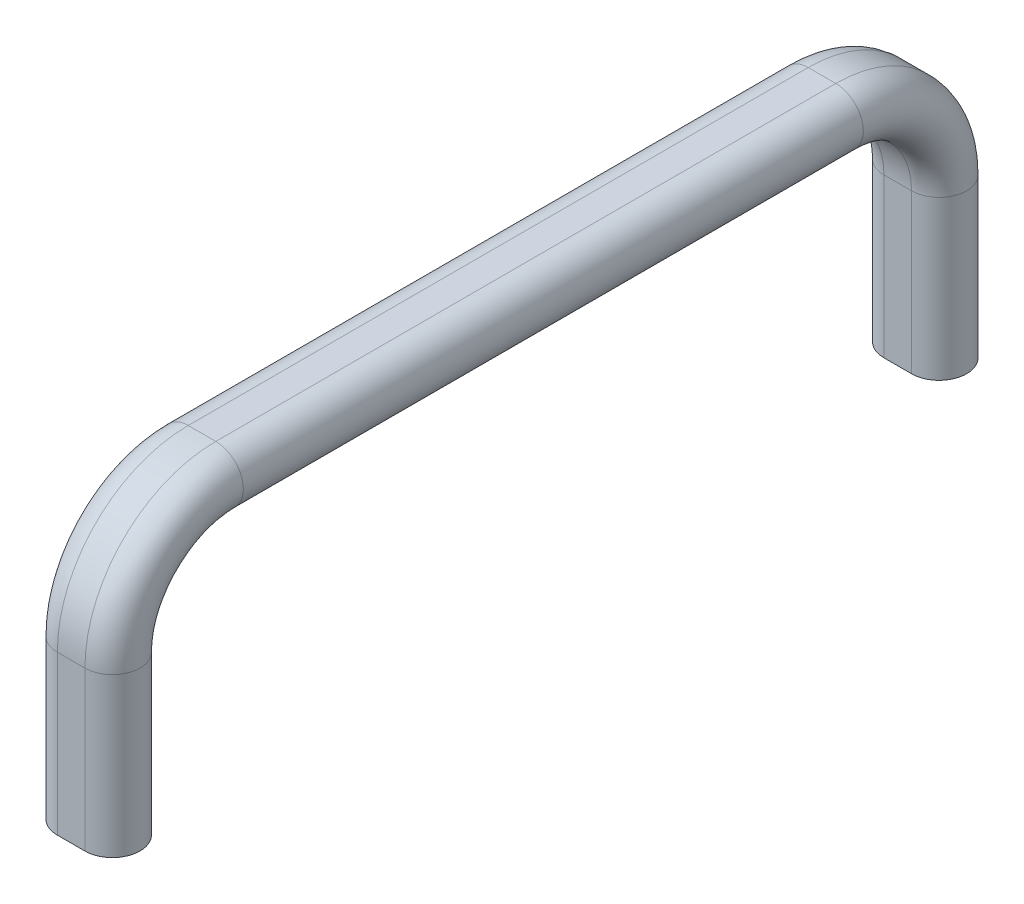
ISO-10303-21;
HEADER;
FILE_DESCRIPTION(('STEP AP214'),'2;1');
FILE_NAME('part.step','',(''),(''),'','','');
FILE_SCHEMA(('AUTOMOTIVE_DESIGN { 1 0 10303 214 1 1 1 1 }'));
ENDSEC;
DATA;
#1=APPLICATION_CONTEXT('core data for automotive mechanical design processes');
#2=APPLICATION_PROTOCOL_DEFINITION('international standard','automotive_design',2000,#1);
#3=PRODUCT_CONTEXT('',#1,'mechanical');
#4=PRODUCT('Part','Part','',(#3));
#5=PRODUCT_RELATED_PRODUCT_CATEGORY('part','',(#4));
#6=PRODUCT_DEFINITION_FORMATION('','',#4);
#7=PRODUCT_DEFINITION_CONTEXT('part definition',#1,'design');
#8=PRODUCT_DEFINITION('design','',#6,#7);
#9=PRODUCT_DEFINITION_SHAPE('','',#8);
#10=(LENGTH_UNIT() NAMED_UNIT(*) SI_UNIT(.MILLI.,.METRE.));
#11=(NAMED_UNIT(*) PLANE_ANGLE_UNIT() SI_UNIT($,.RADIAN.));
#12=(NAMED_UNIT(*) SI_UNIT($,.STERADIAN.) SOLID_ANGLE_UNIT());
#13=UNCERTAINTY_MEASURE_WITH_UNIT(LENGTH_MEASURE(1.E-05),#10,'distance_accuracy_value','');
#14=(GEOMETRIC_REPRESENTATION_CONTEXT(3) GLOBAL_UNCERTAINTY_ASSIGNED_CONTEXT((#13)) GLOBAL_UNIT_ASSIGNED_CONTEXT((#10,
#11,#12)) REPRESENTATION_CONTEXT('',''));
#15=CARTESIAN_POINT('',(0.,0.,0.));
#16=DIRECTION('',(0.,0.,1.));
#17=DIRECTION('',(1.,0.,0.));
#18=AXIS2_PLACEMENT_3D('',#15,#16,#17);
#19=CARTESIAN_POINT('',(0.,-25.,60.));
#20=DIRECTION('',(0.,1.,0.));
#21=DIRECTION('',(0.,0.,1.));
#22=AXIS2_PLACEMENT_3D('',#19,#20,#21);
#23=PLANE('',#22);
#24=CARTESIAN_POINT('',(0.,-25.,60.));
#25=DIRECTION('',(0.,1.,0.));
#26=DIRECTION('',(0.,0.,1.));
#27=AXIS2_PLACEMENT_3D('',#24,#25,#26);
#28=CIRCLE('',#27,2.5);
#29=CARTESIAN_POINT('',(0.,-25.,62.5));
#30=VERTEX_POINT('',#29);
#31=EDGE_CURVE('E18',#30,#30,#28,.F.);
#32=ORIENTED_EDGE('',*,*,#31,.T.);
#33=EDGE_LOOP('',(#32));
#34=FACE_BOUND('',#33,.T.);
#35=ADVANCED_FACE('F15',(#34),#23,.F.);
#36=CARTESIAN_POINT('',(0.,-25.,-60.));
#37=DIRECTION('',(0.,1.,0.));
#38=DIRECTION('',(0.,0.,1.));
#39=AXIS2_PLACEMENT_3D('',#36,#37,#38);
#40=PLANE('',#39);
#41=CARTESIAN_POINT('',(0.,-25.,-60.));
#42=DIRECTION('',(0.,1.,0.));
#43=DIRECTION('',(0.,0.,1.));
#44=AXIS2_PLACEMENT_3D('',#41,#42,#43);
#45=CIRCLE('',#44,2.5);
#46=CARTESIAN_POINT('',(0.,-25.,-57.5));
#47=VERTEX_POINT('',#46);
#48=EDGE_CURVE('E113',#47,#47,#45,.F.);
#49=ORIENTED_EDGE('',*,*,#48,.T.);
#50=EDGE_LOOP('',(#49));
#51=FACE_BOUND('',#50,.T.);
#52=ADVANCED_FACE('F166',(#51),#40,.F.);
#53=CARTESIAN_POINT('',(0.,-38.,60.));
#54=DIRECTION('',(0.,1.,0.));
#55=DIRECTION('',(0.,0.,1.));
#56=AXIS2_PLACEMENT_3D('',#53,#54,#55);
#57=CYLINDRICAL_SURFACE('',#56,2.5);
#58=CARTESIAN_POINT('',(0.,-38.,60.));
#59=DIRECTION('',(0.,1.,0.));
#60=DIRECTION('',(0.,0.,1.));
#61=AXIS2_PLACEMENT_3D('',#58,#59,#60);
#62=CIRCLE('',#61,2.5);
#63=CARTESIAN_POINT('',(0.,-38.,62.5));
#64=VERTEX_POINT('',#63);
#65=EDGE_CURVE('E112',#64,#64,#62,.F.);
#66=ORIENTED_EDGE('',*,*,#65,.T.);
#67=EDGE_LOOP('',(#66));
#68=FACE_BOUND('',#67,.T.);
#69=ORIENTED_EDGE('',*,*,#31,.F.);
#70=EDGE_LOOP('',(#69));
#71=FACE_BOUND('',#70,.T.);
#72=ADVANCED_FACE('F163',(#68,#71),#57,.F.);
#73=CARTESIAN_POINT('',(0.,-38.,-60.));
#74=DIRECTION('',(0.,1.,0.));
#75=DIRECTION('',(0.,0.,1.));
#76=AXIS2_PLACEMENT_3D('',#73,#74,#75);
#77=CYLINDRICAL_SURFACE('',#76,2.5);
#78=CARTESIAN_POINT('',(0.,-38.,-60.));
#79=DIRECTION('',(0.,1.,0.));
#80=DIRECTION('',(0.,0.,1.));
#81=AXIS2_PLACEMENT_3D('',#78,#79,#80);
#82=CIRCLE('',#81,2.5);
#83=CARTESIAN_POINT('',(0.,-38.,-57.5));
#84=VERTEX_POINT('',#83);
#85=EDGE_CURVE('E153',#84,#84,#82,.F.);
#86=ORIENTED_EDGE('',*,*,#85,.T.);
#87=EDGE_LOOP('',(#86));
#88=FACE_BOUND('',#87,.T.);
#89=ORIENTED_EDGE('',*,*,#48,.F.);
#90=EDGE_LOOP('',(#89));
#91=FACE_BOUND('',#90,.T.);
#92=ADVANCED_FACE('F165',(#88,#91),#77,.F.);
#93=CARTESIAN_POINT('',(-2.,-15.,60.));
#94=DIRECTION('',(0.,-1.,0.));
#95=DIRECTION('',(1.,0.,0.));
#96=AXIS2_PLACEMENT_3D('',#93,#94,#95);
#97=CYLINDRICAL_SURFACE('',#96,4.);
#98=CARTESIAN_POINT('',(-2.,-15.,60.));
#99=DIRECTION('',(0.,-1.,0.));
#100=DIRECTION('',(0.,0.,1.));
#101=AXIS2_PLACEMENT_3D('',#98,#99,#100);
#102=CIRCLE('',#101,4.);
#103=CARTESIAN_POINT('',(-2.,-15.,56.));
#104=VERTEX_POINT('',#103);
#105=CARTESIAN_POINT('',(-2.,-15.,64.));
#106=VERTEX_POINT('',#105);
#107=EDGE_CURVE('E119',#104,#106,#102,.F.);
#108=ORIENTED_EDGE('',*,*,#107,.F.);
#109=DIRECTION('',(0.,1.,0.));
#110=VECTOR('',#109,1.);
#111=CARTESIAN_POINT('',(-2.,-15.,56.));
#112=LINE('',#111,#110);
#113=CARTESIAN_POINT('',(-2.,-38.,56.));
#114=VERTEX_POINT('',#113);
#115=EDGE_CURVE('E116',#114,#104,#112,.T.);
#116=ORIENTED_EDGE('',*,*,#115,.F.);
#117=CARTESIAN_POINT('',(-2.,-38.,60.));
#118=DIRECTION('',(0.,-1.,0.));
#119=DIRECTION('',(1.,0.,0.));
#120=AXIS2_PLACEMENT_3D('',#117,#118,#119);
#121=CIRCLE('',#120,4.);
#122=CARTESIAN_POINT('',(-2.,-38.,64.));
#123=VERTEX_POINT('',#122);
#124=EDGE_CURVE('E102',#114,#123,#121,.F.);
#125=ORIENTED_EDGE('',*,*,#124,.T.);
#126=DIRECTION('',(0.,1.,0.));
#127=VECTOR('',#126,1.);
#128=CARTESIAN_POINT('',(-2.,-15.,64.));
#129=LINE('',#128,#127);
#130=EDGE_CURVE('E139',#106,#123,#129,.F.);
#131=ORIENTED_EDGE('',*,*,#130,.F.);
#132=EDGE_LOOP('',(#108,#116,#125,#131));
#133=FACE_BOUND('',#132,.T.);
#134=ADVANCED_FACE('F117',(#133),#97,.T.);
#135=CARTESIAN_POINT('',(-2.,-15.,-60.));
#136=DIRECTION('',(0.,-1.,0.));
#137=DIRECTION('',(1.,0.,0.));
#138=AXIS2_PLACEMENT_3D('',#135,#136,#137);
#139=CYLINDRICAL_SURFACE('',#138,4.);
#140=CARTESIAN_POINT('',(-2.,-15.,-60.));
#141=DIRECTION('',(0.,-1.,0.));
#142=DIRECTION('',(0.,0.,-1.));
#143=AXIS2_PLACEMENT_3D('',#140,#141,#142);
#144=CIRCLE('',#143,4.);
#145=CARTESIAN_POINT('',(-2.,-15.,-64.));
#146=VERTEX_POINT('',#145);
#147=CARTESIAN_POINT('',(-2.,-15.,-56.));
#148=VERTEX_POINT('',#147);
#149=EDGE_CURVE('E152',#146,#148,#144,.F.);
#150=ORIENTED_EDGE('',*,*,#149,.F.);
#151=DIRECTION('',(0.,1.,0.));
#152=VECTOR('',#151,1.);
#153=CARTESIAN_POINT('',(-2.,-15.,-64.));
#154=LINE('',#153,#152);
#155=CARTESIAN_POINT('',(-2.,-38.,-64.));
#156=VERTEX_POINT('',#155);
#157=EDGE_CURVE('E135',#156,#146,#154,.T.);
#158=ORIENTED_EDGE('',*,*,#157,.F.);
#159=CARTESIAN_POINT('',(-2.,-38.,-60.));
#160=DIRECTION('',(0.,-1.,0.));
#161=DIRECTION('',(1.,0.,0.));
#162=AXIS2_PLACEMENT_3D('',#159,#160,#161);
#163=CIRCLE('',#162,4.);
#164=CARTESIAN_POINT('',(-2.,-38.,-56.));
#165=VERTEX_POINT('',#164);
#166=EDGE_CURVE('E123',#156,#165,#163,.F.);
#167=ORIENTED_EDGE('',*,*,#166,.T.);
#168=DIRECTION('',(0.,1.,0.));
#169=VECTOR('',#168,1.);
#170=CARTESIAN_POINT('',(-2.,-15.,-56.));
#171=LINE('',#170,#169);
#172=EDGE_CURVE('E141',#148,#165,#171,.F.);
#173=ORIENTED_EDGE('',*,*,#172,.F.);
#174=EDGE_LOOP('',(#150,#158,#167,#173));
#175=FACE_BOUND('',#174,.T.);
#176=ADVANCED_FACE('F364',(#175),#139,.T.);
#177=CARTESIAN_POINT('',(0.,-38.,60.));
#178=DIRECTION('',(0.,1.,0.));
#179=DIRECTION('',(0.,0.,1.));
#180=AXIS2_PLACEMENT_3D('',#177,#178,#179);
#181=PLANE('',#180);
#182=ORIENTED_EDGE('',*,*,#65,.F.);
#183=EDGE_LOOP('',(#182));
#184=FACE_BOUND('',#183,.T.);
#185=DIRECTION('',(-1.,0.,0.));
#186=VECTOR('',#185,1.);
#187=CARTESIAN_POINT('',(2.,-38.,56.));
#188=LINE('',#187,#186);
#189=CARTESIAN_POINT('',(2.,-38.,56.));
#190=VERTEX_POINT('',#189);
#191=EDGE_CURVE('E106',#190,#114,#188,.T.);
#192=ORIENTED_EDGE('',*,*,#191,.F.);
#193=CARTESIAN_POINT('',(2.,-38.,60.));
#194=DIRECTION('',(0.,-1.,0.));
#195=DIRECTION('',(1.,0.,0.));
#196=AXIS2_PLACEMENT_3D('',#193,#194,#195);
#197=CIRCLE('',#196,4.);
#198=CARTESIAN_POINT('',(2.,-38.,64.));
#199=VERTEX_POINT('',#198);
#200=EDGE_CURVE('E150',#199,#190,#197,.F.);
#201=ORIENTED_EDGE('',*,*,#200,.F.);
#202=DIRECTION('',(1.,0.,0.));
#203=VECTOR('',#202,1.);
#204=CARTESIAN_POINT('',(-2.,-38.,64.));
#205=LINE('',#204,#203);
#206=EDGE_CURVE('E109',#123,#199,#205,.T.);
#207=ORIENTED_EDGE('',*,*,#206,.F.);
#208=ORIENTED_EDGE('',*,*,#124,.F.);
#209=EDGE_LOOP('',(#192,#201,#207,#208));
#210=FACE_BOUND('',#209,.T.);
#211=ADVANCED_FACE('F104',(#184,#210),#181,.F.);
#212=CARTESIAN_POINT('',(2.,-15.,56.));
#213=DIRECTION('',(0.,0.,-1.));
#214=DIRECTION('',(-1.,0.,0.));
#215=AXIS2_PLACEMENT_3D('',#212,#213,#214);
#216=PLANE('',#215);
#217=DIRECTION('',(1.,0.,0.));
#218=VECTOR('',#217,1.);
#219=CARTESIAN_POINT('',(0.,-15.,56.));
#220=LINE('',#219,#218);
#221=CARTESIAN_POINT('',(2.,-15.,56.));
#222=VERTEX_POINT('',#221);
#223=EDGE_CURVE('E149',#104,#222,#220,.T.);
#224=ORIENTED_EDGE('',*,*,#223,.T.);
#225=DIRECTION('',(0.,-1.,0.));
#226=VECTOR('',#225,1.);
#227=CARTESIAN_POINT('',(2.,-15.,56.));
#228=LINE('',#227,#226);
#229=EDGE_CURVE('E127',#190,#222,#228,.F.);
#230=ORIENTED_EDGE('',*,*,#229,.F.);
#231=ORIENTED_EDGE('',*,*,#191,.T.);
#232=ORIENTED_EDGE('',*,*,#115,.T.);
#233=EDGE_LOOP('',(#224,#230,#231,#232));
#234=FACE_BOUND('',#233,.T.);
#235=ADVANCED_FACE('F125',(#234),#216,.T.);
#236=CARTESIAN_POINT('',(0.,-38.,-60.));
#237=DIRECTION('',(0.,1.,0.));
#238=DIRECTION('',(0.,0.,1.));
#239=AXIS2_PLACEMENT_3D('',#236,#237,#238);
#240=PLANE('',#239);
#241=ORIENTED_EDGE('',*,*,#85,.F.);
#242=EDGE_LOOP('',(#241));
#243=FACE_BOUND('',#242,.T.);
#244=DIRECTION('',(1.,0.,0.));
#245=VECTOR('',#244,1.);
#246=CARTESIAN_POINT('',(-2.,-38.,-56.));
#247=LINE('',#246,#245);
#248=CARTESIAN_POINT('',(2.,-38.,-56.));
#249=VERTEX_POINT('',#248);
#250=EDGE_CURVE('E143',#165,#249,#247,.T.);
#251=ORIENTED_EDGE('',*,*,#250,.F.);
#252=ORIENTED_EDGE('',*,*,#166,.F.);
#253=DIRECTION('',(-1.,0.,0.));
#254=VECTOR('',#253,1.);
#255=CARTESIAN_POINT('',(2.,-38.,-64.));
#256=LINE('',#255,#254);
#257=CARTESIAN_POINT('',(2.,-38.,-64.));
#258=VERTEX_POINT('',#257);
#259=EDGE_CURVE('E138',#258,#156,#256,.T.);
#260=ORIENTED_EDGE('',*,*,#259,.F.);
#261=CARTESIAN_POINT('',(2.,-38.,-60.));
#262=DIRECTION('',(0.,-1.,0.));
#263=DIRECTION('',(1.,0.,0.));
#264=AXIS2_PLACEMENT_3D('',#261,#262,#263);
#265=CIRCLE('',#264,4.);
#266=EDGE_CURVE('E145',#249,#258,#265,.F.);
#267=ORIENTED_EDGE('',*,*,#266,.F.);
#268=EDGE_LOOP('',(#251,#252,#260,#267));
#269=FACE_BOUND('',#268,.T.);
#270=ADVANCED_FACE('F355',(#243,#269),#240,.F.);
#271=CARTESIAN_POINT('',(-2.,-15.,-56.));
#272=DIRECTION('',(0.,0.,1.));
#273=DIRECTION('',(1.,0.,0.));
#274=AXIS2_PLACEMENT_3D('',#271,#272,#273);
#275=PLANE('',#274);
#276=DIRECTION('',(-1.,0.,0.));
#277=VECTOR('',#276,1.);
#278=CARTESIAN_POINT('',(0.,-15.,-56.));
#279=LINE('',#278,#277);
#280=CARTESIAN_POINT('',(2.,-15.,-56.));
#281=VERTEX_POINT('',#280);
#282=EDGE_CURVE('E312',#281,#148,#279,.T.);
#283=ORIENTED_EDGE('',*,*,#282,.T.);
#284=ORIENTED_EDGE('',*,*,#172,.T.);
#285=ORIENTED_EDGE('',*,*,#250,.T.);
#286=DIRECTION('',(0.,-1.,0.));
#287=VECTOR('',#286,1.);
#288=CARTESIAN_POINT('',(2.,-15.,-56.));
#289=LINE('',#288,#287);
#290=EDGE_CURVE('E273',#281,#249,#289,.T.);
#291=ORIENTED_EDGE('',*,*,#290,.F.);
#292=EDGE_LOOP('',(#283,#284,#285,#291));
#293=FACE_BOUND('',#292,.T.);
#294=ADVANCED_FACE('F349',(#293),#275,.T.);
#295=CARTESIAN_POINT('',(-2.,-15.,64.));
#296=DIRECTION('',(0.,0.,1.));
#297=DIRECTION('',(1.,0.,0.));
#298=AXIS2_PLACEMENT_3D('',#295,#296,#297);
#299=PLANE('',#298);
#300=DIRECTION('',(1.,0.,0.));
#301=VECTOR('',#300,1.);
#302=CARTESIAN_POINT('',(0.,-15.,64.));
#303=LINE('',#302,#301);
#304=CARTESIAN_POINT('',(2.,-15.,64.));
#305=VERTEX_POINT('',#304);
#306=EDGE_CURVE('E310',#106,#305,#303,.T.);
#307=ORIENTED_EDGE('',*,*,#306,.F.);
#308=ORIENTED_EDGE('',*,*,#130,.T.);
#309=ORIENTED_EDGE('',*,*,#206,.T.);
#310=DIRECTION('',(0.,-1.,0.));
#311=VECTOR('',#310,1.);
#312=CARTESIAN_POINT('',(2.,-15.,64.));
#313=LINE('',#312,#311);
#314=EDGE_CURVE('E281',#305,#199,#313,.T.);
#315=ORIENTED_EDGE('',*,*,#314,.F.);
#316=EDGE_LOOP('',(#307,#308,#309,#315));
#317=FACE_BOUND('',#316,.T.);
#318=ADVANCED_FACE('F343',(#317),#299,.T.);
#319=CARTESIAN_POINT('',(2.,-15.,-64.));
#320=DIRECTION('',(0.,0.,-1.));
#321=DIRECTION('',(-1.,0.,0.));
#322=AXIS2_PLACEMENT_3D('',#319,#320,#321);
#323=PLANE('',#322);
#324=DIRECTION('',(-1.,0.,0.));
#325=VECTOR('',#324,1.);
#326=CARTESIAN_POINT('',(0.,-15.,-64.));
#327=LINE('',#326,#325);
#328=CARTESIAN_POINT('',(2.,-15.,-64.));
#329=VERTEX_POINT('',#328);
#330=EDGE_CURVE('E304',#329,#146,#327,.T.);
#331=ORIENTED_EDGE('',*,*,#330,.F.);
#332=DIRECTION('',(0.,-1.,0.));
#333=VECTOR('',#332,1.);
#334=CARTESIAN_POINT('',(2.,-15.,-64.));
#335=LINE('',#334,#333);
#336=EDGE_CURVE('E148',#258,#329,#335,.F.);
#337=ORIENTED_EDGE('',*,*,#336,.F.);
#338=ORIENTED_EDGE('',*,*,#259,.T.);
#339=ORIENTED_EDGE('',*,*,#157,.T.);
#340=EDGE_LOOP('',(#331,#337,#338,#339));
#341=FACE_BOUND('',#340,.T.);
#342=ADVANCED_FACE('F338',(#341),#323,.T.);
#343=CARTESIAN_POINT('',(-2.,-15.,45.));
#344=DIRECTION('',(1.,0.,0.));
#345=DIRECTION('',(0.,0.,-1.));
#346=AXIS2_PLACEMENT_3D('',#343,#344,#345);
#347=TOROIDAL_SURFACE('',#346,15.,4.);
#348=CARTESIAN_POINT('',(-2.,0.,45.));
#349=DIRECTION('',(0.,0.,1.));
#350=DIRECTION('',(1.,0.,0.));
#351=AXIS2_PLACEMENT_3D('',#348,#349,#350);
#352=CIRCLE('',#351,4.);
#353=CARTESIAN_POINT('',(-2.,-4.,45.));
#354=VERTEX_POINT('',#353);
#355=CARTESIAN_POINT('',(-2.,4.,45.));
#356=VERTEX_POINT('',#355);
#357=EDGE_CURVE('E297',#354,#356,#352,.F.);
#358=ORIENTED_EDGE('',*,*,#357,.F.);
#359=CARTESIAN_POINT('',(-2.,-15.,45.));
#360=DIRECTION('',(1.,0.,0.));
#361=DIRECTION('',(0.,0.,-1.));
#362=AXIS2_PLACEMENT_3D('',#359,#360,#361);
#363=CIRCLE('',#362,11.);
#364=EDGE_CURVE('E265',#354,#104,#363,.T.);
#365=ORIENTED_EDGE('',*,*,#364,.T.);
#366=ORIENTED_EDGE('',*,*,#107,.T.);
#367=CARTESIAN_POINT('',(-2.,-15.,45.));
#368=DIRECTION('',(1.,0.,0.));
#369=DIRECTION('',(0.,0.,-1.));
#370=AXIS2_PLACEMENT_3D('',#367,#368,#369);
#371=CIRCLE('',#370,19.);
#372=EDGE_CURVE('E307',#356,#106,#371,.T.);
#373=ORIENTED_EDGE('',*,*,#372,.F.);
#374=EDGE_LOOP('',(#358,#365,#366,#373));
#375=FACE_BOUND('',#374,.T.);
#376=ADVANCED_FACE('F258',(#375),#347,.T.);
#377=CARTESIAN_POINT('',(-2.,-15.,-45.));
#378=DIRECTION('',(-1.,0.,0.));
#379=DIRECTION('',(0.,0.,1.));
#380=AXIS2_PLACEMENT_3D('',#377,#378,#379);
#381=TOROIDAL_SURFACE('',#380,15.,4.);
#382=CARTESIAN_POINT('',(-2.,0.,-45.));
#383=DIRECTION('',(0.,0.,1.));
#384=DIRECTION('',(1.,0.,0.));
#385=AXIS2_PLACEMENT_3D('',#382,#383,#384);
#386=CIRCLE('',#385,4.);
#387=CARTESIAN_POINT('',(-2.,4.,-45.));
#388=VERTEX_POINT('',#387);
#389=CARTESIAN_POINT('',(-2.,-4.,-45.));
#390=VERTEX_POINT('',#389);
#391=EDGE_CURVE('E294',#388,#390,#386,.T.);
#392=ORIENTED_EDGE('',*,*,#391,.F.);
#393=CARTESIAN_POINT('',(-2.,-15.,-45.));
#394=DIRECTION('',(-1.,0.,0.));
#395=DIRECTION('',(0.,0.,1.));
#396=AXIS2_PLACEMENT_3D('',#393,#394,#395);
#397=CIRCLE('',#396,19.);
#398=EDGE_CURVE('E302',#146,#388,#397,.F.);
#399=ORIENTED_EDGE('',*,*,#398,.F.);
#400=ORIENTED_EDGE('',*,*,#149,.T.);
#401=CARTESIAN_POINT('',(-2.,-15.,-45.));
#402=DIRECTION('',(-1.,0.,0.));
#403=DIRECTION('',(0.,0.,1.));
#404=AXIS2_PLACEMENT_3D('',#401,#402,#403);
#405=CIRCLE('',#404,11.);
#406=EDGE_CURVE('E276',#148,#390,#405,.F.);
#407=ORIENTED_EDGE('',*,*,#406,.T.);
#408=EDGE_LOOP('',(#392,#399,#400,#407));
#409=FACE_BOUND('',#408,.T.);
#410=ADVANCED_FACE('F253',(#409),#381,.T.);
#411=CARTESIAN_POINT('',(2.,-15.,60.));
#412=DIRECTION('',(0.,-1.,0.));
#413=DIRECTION('',(1.,0.,0.));
#414=AXIS2_PLACEMENT_3D('',#411,#412,#413);
#415=CYLINDRICAL_SURFACE('',#414,4.);
#416=CARTESIAN_POINT('',(2.,-15.,60.));
#417=DIRECTION('',(0.,-1.,0.));
#418=DIRECTION('',(0.,0.,1.));
#419=AXIS2_PLACEMENT_3D('',#416,#417,#418);
#420=CIRCLE('',#419,4.);
#421=EDGE_CURVE('E286',#305,#222,#420,.F.);
#422=ORIENTED_EDGE('',*,*,#421,.F.);
#423=ORIENTED_EDGE('',*,*,#314,.T.);
#424=ORIENTED_EDGE('',*,*,#200,.T.);
#425=ORIENTED_EDGE('',*,*,#229,.T.);
#426=EDGE_LOOP('',(#422,#423,#424,#425));
#427=FACE_BOUND('',#426,.T.);
#428=ADVANCED_FACE('F249',(#427),#415,.T.);
#429=CARTESIAN_POINT('',(0.,-15.,45.));
#430=DIRECTION('',(1.,0.,0.));
#431=DIRECTION('',(0.,0.,-1.));
#432=AXIS2_PLACEMENT_3D('',#429,#430,#431);
#433=CYLINDRICAL_SURFACE('',#432,11.);
#434=ORIENTED_EDGE('',*,*,#364,.F.);
#435=DIRECTION('',(1.,0.,0.));
#436=VECTOR('',#435,1.);
#437=CARTESIAN_POINT('',(2.,-4.,45.));
#438=LINE('',#437,#436);
#439=CARTESIAN_POINT('',(2.,-4.,45.));
#440=VERTEX_POINT('',#439);
#441=EDGE_CURVE('E216',#440,#354,#438,.F.);
#442=ORIENTED_EDGE('',*,*,#441,.F.);
#443=CARTESIAN_POINT('',(2.,-15.,45.));
#444=DIRECTION('',(1.,0.,0.));
#445=DIRECTION('',(0.,0.,-1.));
#446=AXIS2_PLACEMENT_3D('',#443,#444,#445);
#447=CIRCLE('',#446,11.);
#448=EDGE_CURVE('E289',#222,#440,#447,.F.);
#449=ORIENTED_EDGE('',*,*,#448,.F.);
#450=ORIENTED_EDGE('',*,*,#223,.F.);
#451=EDGE_LOOP('',(#434,#442,#449,#450));
#452=FACE_BOUND('',#451,.T.);
#453=ADVANCED_FACE('F245',(#452),#433,.F.);
#454=CARTESIAN_POINT('',(2.,-15.,-60.));
#455=DIRECTION('',(0.,-1.,0.));
#456=DIRECTION('',(1.,0.,0.));
#457=AXIS2_PLACEMENT_3D('',#454,#455,#456);
#458=CYLINDRICAL_SURFACE('',#457,4.);
#459=CARTESIAN_POINT('',(2.,-15.,-60.));
#460=DIRECTION('',(0.,-1.,0.));
#461=DIRECTION('',(0.,0.,-1.));
#462=AXIS2_PLACEMENT_3D('',#459,#460,#461);
#463=CIRCLE('',#462,4.);
#464=EDGE_CURVE('E207',#281,#329,#463,.F.);
#465=ORIENTED_EDGE('',*,*,#464,.F.);
#466=ORIENTED_EDGE('',*,*,#290,.T.);
#467=ORIENTED_EDGE('',*,*,#266,.T.);
#468=ORIENTED_EDGE('',*,*,#336,.T.);
#469=EDGE_LOOP('',(#465,#466,#467,#468));
#470=FACE_BOUND('',#469,.T.);
#471=ADVANCED_FACE('F241',(#470),#458,.T.);
#472=CARTESIAN_POINT('',(0.,-15.,-45.));
#473=DIRECTION('',(-1.,0.,0.));
#474=DIRECTION('',(0.,0.,1.));
#475=AXIS2_PLACEMENT_3D('',#472,#473,#474);
#476=CYLINDRICAL_SURFACE('',#475,11.);
#477=CARTESIAN_POINT('',(2.,-15.,-45.));
#478=DIRECTION('',(-1.,0.,0.));
#479=DIRECTION('',(0.,0.,1.));
#480=AXIS2_PLACEMENT_3D('',#477,#478,#479);
#481=CIRCLE('',#480,11.);
#482=CARTESIAN_POINT('',(2.,-4.,-45.));
#483=VERTEX_POINT('',#482);
#484=EDGE_CURVE('E202',#483,#281,#481,.T.);
#485=ORIENTED_EDGE('',*,*,#484,.F.);
#486=DIRECTION('',(1.,0.,0.));
#487=VECTOR('',#486,1.);
#488=CARTESIAN_POINT('',(2.,-4.,-45.));
#489=LINE('',#488,#487);
#490=EDGE_CURVE('E210',#390,#483,#489,.T.);
#491=ORIENTED_EDGE('',*,*,#490,.F.);
#492=ORIENTED_EDGE('',*,*,#406,.F.);
#493=ORIENTED_EDGE('',*,*,#282,.F.);
#494=EDGE_LOOP('',(#485,#491,#492,#493));
#495=FACE_BOUND('',#494,.T.);
#496=ADVANCED_FACE('F237',(#495),#476,.F.);
#497=CARTESIAN_POINT('',(0.,-15.,45.));
#498=DIRECTION('',(1.,0.,0.));
#499=DIRECTION('',(0.,0.,-1.));
#500=AXIS2_PLACEMENT_3D('',#497,#498,#499);
#501=CYLINDRICAL_SURFACE('',#500,19.);
#502=DIRECTION('',(1.,0.,0.));
#503=VECTOR('',#502,1.);
#504=CARTESIAN_POINT('',(-2.,4.,45.));
#505=LINE('',#504,#503);
#506=CARTESIAN_POINT('',(2.,4.,45.));
#507=VERTEX_POINT('',#506);
#508=EDGE_CURVE('E200',#356,#507,#505,.T.);
#509=ORIENTED_EDGE('',*,*,#508,.F.);
#510=ORIENTED_EDGE('',*,*,#372,.T.);
#511=ORIENTED_EDGE('',*,*,#306,.T.);
#512=CARTESIAN_POINT('',(2.,-15.,45.));
#513=DIRECTION('',(1.,0.,0.));
#514=DIRECTION('',(0.,0.,-1.));
#515=AXIS2_PLACEMENT_3D('',#512,#513,#514);
#516=CIRCLE('',#515,19.);
#517=EDGE_CURVE('E219',#507,#305,#516,.T.);
#518=ORIENTED_EDGE('',*,*,#517,.F.);
#519=EDGE_LOOP('',(#509,#510,#511,#518));
#520=FACE_BOUND('',#519,.T.);
#521=ADVANCED_FACE('F234',(#520),#501,.T.);
#522=CARTESIAN_POINT('',(0.,-15.,-45.));
#523=DIRECTION('',(-1.,0.,0.));
#524=DIRECTION('',(0.,0.,1.));
#525=AXIS2_PLACEMENT_3D('',#522,#523,#524);
#526=CYLINDRICAL_SURFACE('',#525,19.);
#527=DIRECTION('',(1.,0.,0.));
#528=VECTOR('',#527,1.);
#529=CARTESIAN_POINT('',(-2.,4.,-45.));
#530=LINE('',#529,#528);
#531=CARTESIAN_POINT('',(2.,4.,-45.));
#532=VERTEX_POINT('',#531);
#533=EDGE_CURVE('E33',#532,#388,#530,.F.);
#534=ORIENTED_EDGE('',*,*,#533,.F.);
#535=CARTESIAN_POINT('',(2.,-15.,-45.));
#536=DIRECTION('',(-1.,0.,0.));
#537=DIRECTION('',(0.,0.,1.));
#538=AXIS2_PLACEMENT_3D('',#535,#536,#537);
#539=CIRCLE('',#538,19.);
#540=EDGE_CURVE('E205',#329,#532,#539,.F.);
#541=ORIENTED_EDGE('',*,*,#540,.F.);
#542=ORIENTED_EDGE('',*,*,#330,.T.);
#543=ORIENTED_EDGE('',*,*,#398,.T.);
#544=EDGE_LOOP('',(#534,#541,#542,#543));
#545=FACE_BOUND('',#544,.T.);
#546=ADVANCED_FACE('F230',(#545),#526,.T.);
#547=CARTESIAN_POINT('',(-2.,0.,0.));
#548=DIRECTION('',(0.,0.,1.));
#549=DIRECTION('',(1.,0.,0.));
#550=AXIS2_PLACEMENT_3D('',#547,#548,#549);
#551=CYLINDRICAL_SURFACE('',#550,4.);
#552=ORIENTED_EDGE('',*,*,#391,.T.);
#553=DIRECTION('',(0.,0.,-1.));
#554=VECTOR('',#553,1.);
#555=CARTESIAN_POINT('',(-2.,-4.,0.));
#556=LINE('',#555,#554);
#557=EDGE_CURVE('E213',#354,#390,#556,.T.);
#558=ORIENTED_EDGE('',*,*,#557,.F.);
#559=ORIENTED_EDGE('',*,*,#357,.T.);
#560=DIRECTION('',(0.,0.,1.));
#561=VECTOR('',#560,1.);
#562=CARTESIAN_POINT('',(-2.,4.,0.));
#563=LINE('',#562,#561);
#564=EDGE_CURVE('E322',#388,#356,#563,.T.);
#565=ORIENTED_EDGE('',*,*,#564,.F.);
#566=EDGE_LOOP('',(#552,#558,#559,#565));
#567=FACE_BOUND('',#566,.T.);
#568=ADVANCED_FACE('F226',(#567),#551,.T.);
#569=CARTESIAN_POINT('',(2.,-15.,45.));
#570=DIRECTION('',(1.,0.,0.));
#571=DIRECTION('',(0.,0.,-1.));
#572=AXIS2_PLACEMENT_3D('',#569,#570,#571);
#573=TOROIDAL_SURFACE('',#572,15.,4.);
#574=CARTESIAN_POINT('',(2.,0.,45.));
#575=DIRECTION('',(0.,0.,1.));
#576=DIRECTION('',(1.,0.,0.));
#577=AXIS2_PLACEMENT_3D('',#574,#575,#576);
#578=CIRCLE('',#577,4.);
#579=EDGE_CURVE('E328',#507,#440,#578,.F.);
#580=ORIENTED_EDGE('',*,*,#579,.F.);
#581=ORIENTED_EDGE('',*,*,#517,.T.);
#582=ORIENTED_EDGE('',*,*,#421,.T.);
#583=ORIENTED_EDGE('',*,*,#448,.T.);
#584=EDGE_LOOP('',(#580,#581,#582,#583));
#585=FACE_BOUND('',#584,.T.);
#586=ADVANCED_FACE('F223',(#585),#573,.T.);
#587=CARTESIAN_POINT('',(2.,-4.,0.));
#588=DIRECTION('',(0.,-1.,0.));
#589=DIRECTION('',(0.,0.,-1.));
#590=AXIS2_PLACEMENT_3D('',#587,#588,#589);
#591=PLANE('',#590);
#592=ORIENTED_EDGE('',*,*,#490,.T.);
#593=DIRECTION('',(0.,0.,1.));
#594=VECTOR('',#593,1.);
#595=CARTESIAN_POINT('',(2.,-4.,0.));
#596=LINE('',#595,#594);
#597=EDGE_CURVE('E326',#440,#483,#596,.F.);
#598=ORIENTED_EDGE('',*,*,#597,.F.);
#599=ORIENTED_EDGE('',*,*,#441,.T.);
#600=ORIENTED_EDGE('',*,*,#557,.T.);
#601=EDGE_LOOP('',(#592,#598,#599,#600));
#602=FACE_BOUND('',#601,.T.);
#603=ADVANCED_FACE('F194',(#602),#591,.T.);
#604=CARTESIAN_POINT('',(2.,-15.,-45.));
#605=DIRECTION('',(-1.,0.,0.));
#606=DIRECTION('',(0.,0.,1.));
#607=AXIS2_PLACEMENT_3D('',#604,#605,#606);
#608=TOROIDAL_SURFACE('',#607,15.,4.);
#609=CARTESIAN_POINT('',(2.,0.,-45.));
#610=DIRECTION('',(0.,0.,1.));
#611=DIRECTION('',(1.,0.,0.));
#612=AXIS2_PLACEMENT_3D('',#609,#610,#611);
#613=CIRCLE('',#612,4.);
#614=EDGE_CURVE('E24',#483,#532,#613,.T.);
#615=ORIENTED_EDGE('',*,*,#614,.F.);
#616=ORIENTED_EDGE('',*,*,#484,.T.);
#617=ORIENTED_EDGE('',*,*,#464,.T.);
#618=ORIENTED_EDGE('',*,*,#540,.T.);
#619=EDGE_LOOP('',(#615,#616,#617,#618));
#620=FACE_BOUND('',#619,.T.);
#621=ADVANCED_FACE('F186',(#620),#608,.T.);
#622=CARTESIAN_POINT('',(-2.,4.,0.));
#623=DIRECTION('',(0.,1.,0.));
#624=DIRECTION('',(0.,0.,1.));
#625=AXIS2_PLACEMENT_3D('',#622,#623,#624);
#626=PLANE('',#625);
#627=ORIENTED_EDGE('',*,*,#533,.T.);
#628=ORIENTED_EDGE('',*,*,#564,.T.);
#629=ORIENTED_EDGE('',*,*,#508,.T.);
#630=DIRECTION('',(0.,0.,1.));
#631=VECTOR('',#630,1.);
#632=CARTESIAN_POINT('',(2.,4.,0.));
#633=LINE('',#632,#631);
#634=EDGE_CURVE('E10',#532,#507,#633,.T.);
#635=ORIENTED_EDGE('',*,*,#634,.F.);
#636=EDGE_LOOP('',(#627,#628,#629,#635));
#637=FACE_BOUND('',#636,.T.);
#638=ADVANCED_FACE('F179',(#637),#626,.T.);
#639=CARTESIAN_POINT('',(2.,0.,0.));
#640=DIRECTION('',(0.,0.,1.));
#641=DIRECTION('',(1.,0.,0.));
#642=AXIS2_PLACEMENT_3D('',#639,#640,#641);
#643=CYLINDRICAL_SURFACE('',#642,4.);
#644=ORIENTED_EDGE('',*,*,#614,.T.);
#645=ORIENTED_EDGE('',*,*,#634,.T.);
#646=ORIENTED_EDGE('',*,*,#579,.T.);
#647=ORIENTED_EDGE('',*,*,#597,.T.);
#648=EDGE_LOOP('',(#644,#645,#646,#647));
#649=FACE_BOUND('',#648,.T.);
#650=ADVANCED_FACE('F177',(#649),#643,.T.);
#651=CLOSED_SHELL('',(#35,#52,#72,#92,#134,#176,#211,#235,#270,#294,#318,#342,#376,#410,#428,
#453,#471,#496,#521,#546,#568,#586,#603,#621,#638,#650));
#652=MANIFOLD_SOLID_BREP('B1',#651);
#653=ADVANCED_BREP_SHAPE_REPRESENTATION('',(#18,#652),#14);
#654=SHAPE_DEFINITION_REPRESENTATION(#9,#653);
ENDSEC;
END-ISO-10303-21;
